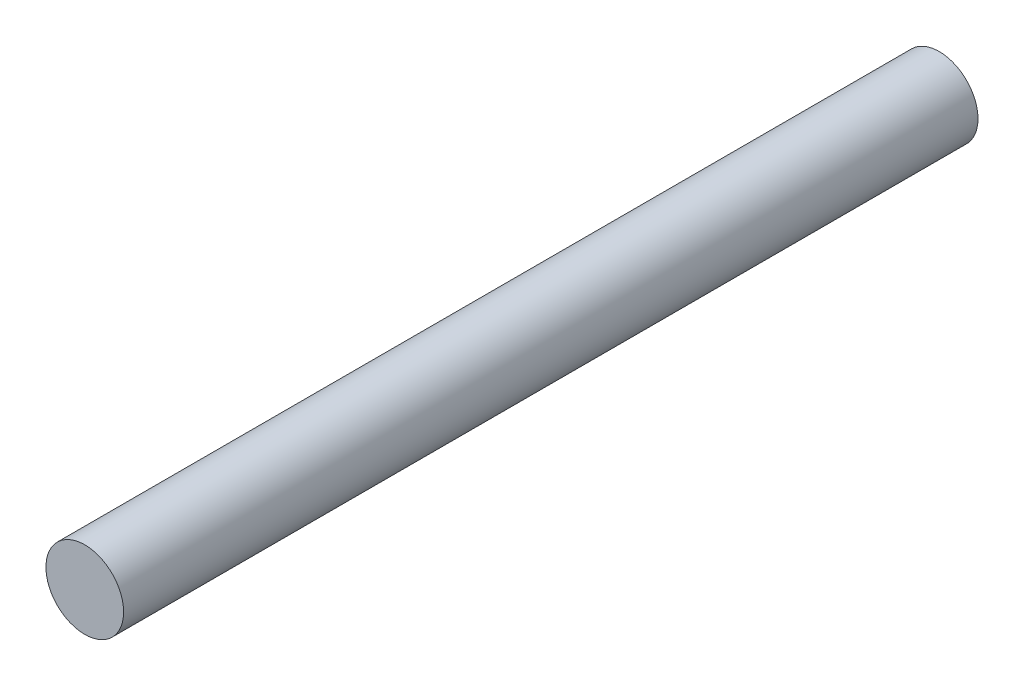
ISO-10303-21;
HEADER;
FILE_DESCRIPTION(('STEP AP214'),'2;1');
FILE_NAME('part.step','',(''),(''),'','','');
FILE_SCHEMA(('AUTOMOTIVE_DESIGN { 1 0 10303 214 1 1 1 1 }'));
ENDSEC;
DATA;
#1=APPLICATION_CONTEXT('core data for automotive mechanical design processes');
#2=APPLICATION_PROTOCOL_DEFINITION('international standard','automotive_design',2000,#1);
#3=PRODUCT_CONTEXT('',#1,'mechanical');
#4=PRODUCT('Part','Part','',(#3));
#5=PRODUCT_RELATED_PRODUCT_CATEGORY('part','',(#4));
#6=PRODUCT_DEFINITION_FORMATION('','',#4);
#7=PRODUCT_DEFINITION_CONTEXT('part definition',#1,'design');
#8=PRODUCT_DEFINITION('design','',#6,#7);
#9=PRODUCT_DEFINITION_SHAPE('','',#8);
#10=(LENGTH_UNIT() NAMED_UNIT(*) SI_UNIT(.MILLI.,.METRE.));
#11=(NAMED_UNIT(*) PLANE_ANGLE_UNIT() SI_UNIT($,.RADIAN.));
#12=(NAMED_UNIT(*) SI_UNIT($,.STERADIAN.) SOLID_ANGLE_UNIT());
#13=UNCERTAINTY_MEASURE_WITH_UNIT(LENGTH_MEASURE(1.E-05),#10,'distance_accuracy_value','');
#14=(GEOMETRIC_REPRESENTATION_CONTEXT(3) GLOBAL_UNCERTAINTY_ASSIGNED_CONTEXT((#13)) GLOBAL_UNIT_ASSIGNED_CONTEXT((#10,
#11,#12)) REPRESENTATION_CONTEXT('',''));
#15=CARTESIAN_POINT('',(0.,0.,0.));
#16=DIRECTION('',(0.,0.,1.));
#17=DIRECTION('',(1.,0.,0.));
#18=AXIS2_PLACEMENT_3D('',#15,#16,#17);
#19=CARTESIAN_POINT('',(36.3601743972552,-10.,55.));
#20=DIRECTION('',(0.,0.,-1.));
#21=DIRECTION('',(-1.,0.,0.));
#22=AXIS2_PLACEMENT_3D('',#19,#20,#21);
#23=CYLINDRICAL_SURFACE('',#22,2.5);
#24=CARTESIAN_POINT('',(36.3601743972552,-10.,55.));
#25=DIRECTION('',(0.,0.,1.));
#26=DIRECTION('',(1.,0.,0.));
#27=AXIS2_PLACEMENT_3D('',#24,#25,#26);
#28=CIRCLE('',#27,2.5);
#29=CARTESIAN_POINT('',(38.8601743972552,-10.,55.));
#30=VERTEX_POINT('',#29);
#31=EDGE_CURVE('E11',#30,#30,#28,.T.);
#32=ORIENTED_EDGE('',*,*,#31,.F.);
#33=EDGE_LOOP('',(#32));
#34=FACE_BOUND('',#33,.T.);
#35=CARTESIAN_POINT('',(36.3601743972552,-10.,0.));
#36=DIRECTION('',(0.,0.,1.));
#37=DIRECTION('',(1.,0.,0.));
#38=AXIS2_PLACEMENT_3D('',#35,#36,#37);
#39=CIRCLE('',#38,2.5);
#40=CARTESIAN_POINT('',(38.8601743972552,-10.,0.));
#41=VERTEX_POINT('',#40);
#42=EDGE_CURVE('E19',#41,#41,#39,.T.);
#43=ORIENTED_EDGE('',*,*,#42,.T.);
#44=EDGE_LOOP('',(#43));
#45=FACE_BOUND('',#44,.T.);
#46=ADVANCED_FACE('F16',(#34,#45),#23,.T.);
#47=CARTESIAN_POINT('',(36.3601743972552,-10.,55.));
#48=DIRECTION('',(0.,0.,1.));
#49=DIRECTION('',(1.,0.,0.));
#50=AXIS2_PLACEMENT_3D('',#47,#48,#49);
#51=PLANE('',#50);
#52=ORIENTED_EDGE('',*,*,#31,.T.);
#53=EDGE_LOOP('',(#52));
#54=FACE_BOUND('',#53,.T.);
#55=ADVANCED_FACE('F45',(#54),#51,.T.);
#56=CARTESIAN_POINT('',(36.3601743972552,-10.,0.));
#57=DIRECTION('',(0.,0.,1.));
#58=DIRECTION('',(1.,0.,0.));
#59=AXIS2_PLACEMENT_3D('',#56,#57,#58);
#60=PLANE('',#59);
#61=CARTESIAN_POINT('',(36.3601743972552,-10.,0.));
#62=DIRECTION('',(0.,0.,-1.));
#63=DIRECTION('',(-1.,0.,0.));
#64=AXIS2_PLACEMENT_3D('',#61,#62,#63);
#65=CIRCLE('',#64,1.24999999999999);
#66=CARTESIAN_POINT('',(35.1101743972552,-10.,0.));
#67=VERTEX_POINT('',#66);
#68=EDGE_CURVE('E35',#67,#67,#65,.T.);
#69=ORIENTED_EDGE('',*,*,#68,.F.);
#70=EDGE_LOOP('',(#69));
#71=FACE_BOUND('',#70,.T.);
#72=ORIENTED_EDGE('',*,*,#42,.F.);
#73=EDGE_LOOP('',(#72));
#74=FACE_BOUND('',#73,.T.);
#75=ADVANCED_FACE('F29',(#71,#74),#60,.F.);
#76=CARTESIAN_POINT('',(36.3601743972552,-10.,13.5));
#77=DIRECTION('',(0.,0.,-1.));
#78=DIRECTION('',(-1.,0.,0.));
#79=AXIS2_PLACEMENT_3D('',#76,#77,#78);
#80=CONICAL_SURFACE('',#79,1.25,1.02974425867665);
#81=CARTESIAN_POINT('',(36.3601743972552,-10.,14.2510757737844));
#82=VERTEX_POINT('',#81);
#83=VERTEX_LOOP('',#82);
#84=FACE_BOUND('',#83,.T.);
#85=CARTESIAN_POINT('',(36.3601743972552,-10.,13.5));
#86=DIRECTION('',(0.,0.,-1.));
#87=DIRECTION('',(-1.,0.,0.));
#88=AXIS2_PLACEMENT_3D('',#85,#86,#87);
#89=CIRCLE('',#88,1.25);
#90=CARTESIAN_POINT('',(35.1101743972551,-10.,13.5));
#91=VERTEX_POINT('',#90);
#92=EDGE_CURVE('E33',#91,#91,#89,.T.);
#93=ORIENTED_EDGE('',*,*,#92,.T.);
#94=EDGE_LOOP('',(#93));
#95=FACE_BOUND('',#94,.T.);
#96=ADVANCED_FACE('F25',(#84,#95),#80,.F.);
#97=CARTESIAN_POINT('',(36.3601743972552,-10.,0.));
#98=DIRECTION('',(0.,0.,-1.));
#99=DIRECTION('',(-1.,0.,0.));
#100=AXIS2_PLACEMENT_3D('',#97,#98,#99);
#101=CYLINDRICAL_SURFACE('',#100,1.25);
#102=ORIENTED_EDGE('',*,*,#92,.F.);
#103=EDGE_LOOP('',(#102));
#104=FACE_BOUND('',#103,.T.);
#105=ORIENTED_EDGE('',*,*,#68,.T.);
#106=EDGE_LOOP('',(#105));
#107=FACE_BOUND('',#106,.T.);
#108=ADVANCED_FACE('F28',(#104,#107),#101,.F.);
#109=CLOSED_SHELL('',(#46,#55,#75,#96,#108));
#110=MANIFOLD_SOLID_BREP('B1',#109);
#111=ADVANCED_BREP_SHAPE_REPRESENTATION('',(#18,#110),#14);
#112=SHAPE_DEFINITION_REPRESENTATION(#9,#111);
ENDSEC;
END-ISO-10303-21;
